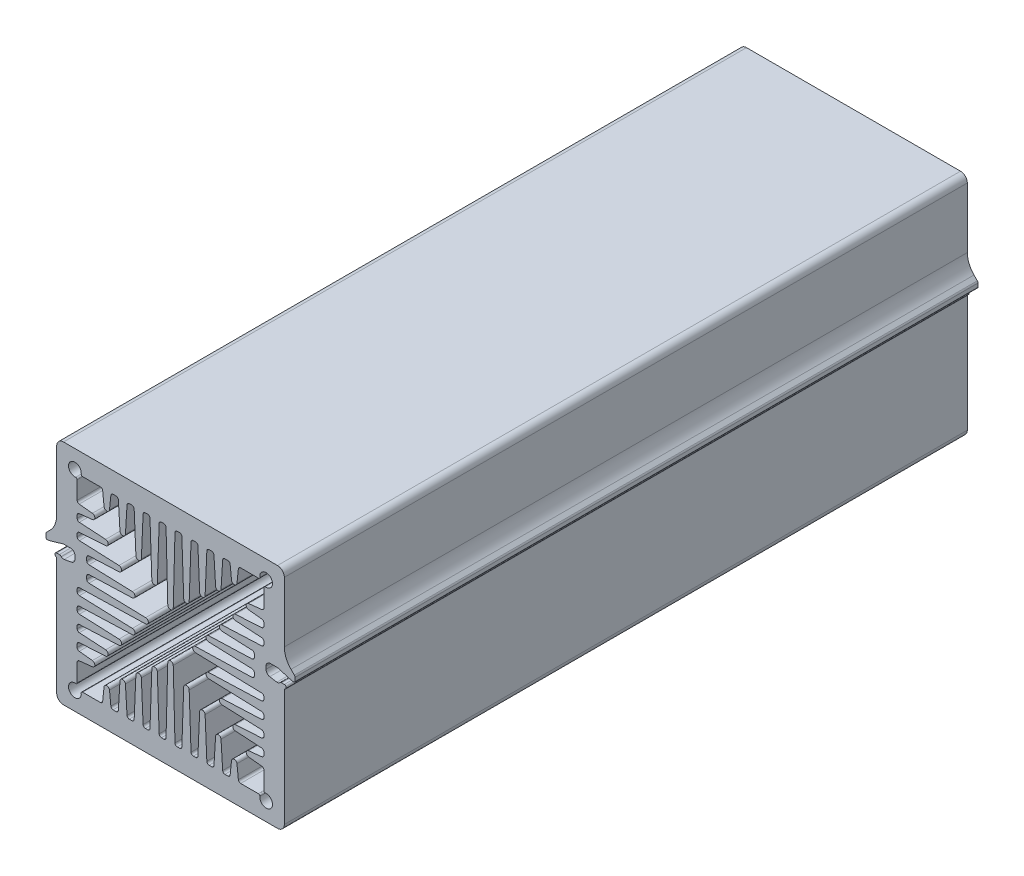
from build123d import *

# Parameters (mm, degrees)
BOSS_EXTRUDE1_DEPTH = 150


with BuildPart() as part:
    # Sketch1 → Boss-Extrude1 (new body)
    with BuildSketch(Plane(origin=(0, 0, 0), x_dir=(-1, 0, 0), z_dir=(0, 0, -1))):
        with BuildLine():
            Line((3e-09, 35.269754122), (3e-09, 48.499999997))
            ThreePointArc((3e-09, 48.499999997), (-0.439339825, 49.560660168), (-1.499999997, 49.999999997))
            Line((-1.499999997, 49.999999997), (-48.499999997, 49.999999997))
            ThreePointArc((-48.499999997, 49.999999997), (-49.560660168, 49.560660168), (-49.999999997, 48.499999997))
            Line((-49.999999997, 48.499999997), (-49.999999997, 35.269754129))
            ThreePointArc((-49.999999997, 35.269754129), (-50.380602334, 33.356336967), (-51.464466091, 31.734220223))
            Line((-51.464466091, 31.734220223), (-52.198025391, 31.000660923))
            ThreePointArc((-52.198025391, 31.000660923), (-52.306411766, 30.838449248), (-52.344472, 30.647107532))
            Line((-52.344472, 30.647107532), (-52.344472, 29.847107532))
            ThreePointArc((-52.344472, 29.847107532), (-52.285893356, 29.705686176), (-52.144472, 29.647107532))
            Line((-52.144472, 29.647107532), (-51.857732, 29.647107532))
            ThreePointArc((-51.857732, 29.647107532), (-51.716083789, 29.657190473), (-51.577292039, 29.687235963))
            Line((-51.577292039, 29.687235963), (-48.641505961, 30.544967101))
            ThreePointArc((-48.641505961, 30.544967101), (-48.502714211, 30.575012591), (-48.361066, 30.585095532))
            Line((-48.361066, 30.585095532), (-46.969175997, 30.585095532))
            ThreePointArc((-46.969175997, 30.585095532), (-46.262069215, 30.292202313), (-45.969175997, 29.585095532))
            Line((-45.969175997, 29.585095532), (-45.969175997, 28.987326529))
            ThreePointArc((-45.969175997, 28.987326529), (-46.204101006, 28.343385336), (-46.798496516, 28.001999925))
            Line((-46.798496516, 28.001999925), (-48.35098536, 27.733075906))
            ThreePointArc((-48.35098536, 27.733075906), (-48.69363657, 27.759334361), (-48.982498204, 27.945501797))
            ThreePointArc((-48.982498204, 27.945501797), (-49.177977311, 28.083694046), (-49.412352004, 28.132455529))
            Line((-49.412352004, 28.132455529), (-49.999999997, 28.132455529))
            ThreePointArc((-49.999999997, 28.132455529), (-50.390231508, 27.820315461), (-50.171428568, 27.371052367))
            ThreePointArc((-50.171428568, 27.371052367), (-50.04645372, 27.260356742), (-49.999999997, 27.099999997))
            Line((-49.999999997, 27.099999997), (-49.999999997, 1.499999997))
            ThreePointArc((-49.999999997, 1.499999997), (-49.560660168, 0.439339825), (-48.499999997, -3e-09))
            Line((-48.499999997, -3e-09), (-1.499999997, -3e-09))
            ThreePointArc((-1.499999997, -3e-09), (-0.439339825, 0.439339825), (3e-09, 1.499999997))
            Line((3e-09, 1.499999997), (3e-09, 27.099999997))
            ThreePointArc((3e-09, 27.099999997), (0.046453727, 27.260356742), (0.171428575, 27.371052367))
            ThreePointArc((0.171428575, 27.371052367), (0.390231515, 27.820315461), (3e-09, 28.132455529))
            Line((3e-09, 28.132455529), (-0.587647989, 28.132455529))
            ThreePointArc((-0.587647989, 28.132455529), (-0.822022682, 28.083694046), (-1.017501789, 27.945501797))
            ThreePointArc((-1.017501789, 27.945501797), (-1.306363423, 27.759334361), (-1.649014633, 27.733075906))
            Line((-1.649014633, 27.733075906), (-3.201503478, 28.001999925))
            ThreePointArc((-3.201503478, 28.001999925), (-3.795898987, 28.343385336), (-4.030823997, 28.987326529))
            Line((-4.030823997, 28.987326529), (-4.030823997, 29.585095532))
            ThreePointArc((-4.030823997, 29.585095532), (-3.737930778, 30.292202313), (-3.030823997, 30.585095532))
            Line((-3.030823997, 30.585095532), (-1.638934, 30.585095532))
            ThreePointArc((-1.638934, 30.585095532), (-1.497285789, 30.575012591), (-1.358494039, 30.544967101))
            Line((-1.358494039, 30.544967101), (1.577292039, 29.687235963))
            ThreePointArc((1.577292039, 29.687235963), (1.716083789, 29.657190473), (1.857732, 29.647107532))
            Line((1.857732, 29.647107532), (2.144472, 29.647107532))
            ThreePointArc((2.144472, 29.647107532), (2.285893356, 29.705686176), (2.344472, 29.847107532))
            Line((2.344472, 29.847107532), (2.344472, 30.647107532))
            ThreePointArc((2.344472, 30.647107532), (2.306411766, 30.838449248), (2.198025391, 31.000660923))
            Line((2.198025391, 31.000660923), (1.464466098, 31.734220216))
            ThreePointArc((1.464466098, 31.734220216), (0.380602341, 33.35633696), (3e-09, 35.269754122))
        make_face()
        with BuildLine():
            Line((-44.311805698, 45.5), (-40.399299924, 45.5))
            ThreePointArc((-40.399299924, 45.5), (-40.064734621, 45.371572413), (-39.902038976, 45.052264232))
            Line((-39.902038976, 45.052264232), (-39.596713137, 42.147282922))
            ThreePointArc((-39.596713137, 42.147282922), (-39, 41.61), (-38.403286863, 42.147282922))
            Line((-38.403286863, 42.147282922), (-38.097961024, 45.052264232))
            ThreePointArc((-38.097961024, 45.052264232), (-37.935265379, 45.371572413), (-37.600700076, 45.5))
            Line((-37.600700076, 45.5), (-36.951905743, 45.5))
            ThreePointArc((-36.951905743, 45.5), (-36.609314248, 45.364185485), (-36.452838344, 45.03052427))
            Line((-36.452838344, 45.03052427), (-36.098880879, 39.243370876))
            ThreePointArc((-36.098880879, 39.243370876), (-35.5, 38.68), (-34.901119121, 39.243370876))
            Line((-34.901119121, 39.243370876), (-34.547161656, 45.03052427))
            ThreePointArc((-34.547161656, 45.03052427), (-34.390685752, 45.364185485), (-34.048094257, 45.5))
            Line((-34.048094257, 45.5), (-33.479151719, 45.5))
            ThreePointArc((-33.479151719, 45.5), (-33.133395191, 45.361181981), (-32.979627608, 45.021809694))
            Line((-32.979627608, 45.021809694), (-32.599428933, 36.313828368))
            ThreePointArc((-32.599428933, 36.313828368), (-32, 35.74), (-31.400571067, 36.313828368))
            Line((-31.400571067, 36.313828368), (-31.020372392, 45.021809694))
            ThreePointArc((-31.020372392, 45.021809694), (-30.866604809, 45.361181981), (-30.520848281, 45.5))
            Line((-30.520848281, 45.5), (-30.005751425, 45.5))
            ThreePointArc((-30.005751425, 45.5), (-29.65842224, 45.3596699), (-29.506056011, 45.017449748))
            Line((-29.506056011, 45.017449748), (-29.099634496, 33.379060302))
            ThreePointArc((-29.099634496, 33.379060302), (-28.5, 32.8), (-27.900365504, 33.379060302))
            Line((-27.900365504, 33.379060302), (-27.493943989, 45.017449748))
            ThreePointArc((-27.493943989, 45.017449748), (-27.34157776, 45.3596699), (-26.994248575, 45.5))
            Line((-26.994248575, 45.5), (-26.480727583, 45.5))
            ThreePointArc((-26.480727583, 45.5), (-26.131832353, 45.358150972), (-25.98089892, 45.013088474))
            Line((-25.98089892, 45.013088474), (-25.599794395, 30.459293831))
            ThreePointArc((-25.599794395, 30.459293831), (-25, 29.875), (-24.400205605, 30.459293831))
            Line((-24.400205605, 30.459293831), (-24.01910108, 45.013088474))
            ThreePointArc((-24.01910108, 45.013088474), (-23.868167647, 45.358150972), (-23.519272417, 45.5))
            Line((-23.519272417, 45.5), (-23.005751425, 45.5))
            ThreePointArc((-23.005751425, 45.5), (-22.65842224, 45.3596699), (-22.506056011, 45.017449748))
            Line((-22.506056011, 45.017449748), (-22.099634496, 33.379060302))
            ThreePointArc((-22.099634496, 33.379060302), (-21.5, 32.8), (-20.900365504, 33.379060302))
            Line((-20.900365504, 33.379060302), (-20.493943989, 45.017449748))
            ThreePointArc((-20.493943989, 45.017449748), (-20.34157776, 45.3596699), (-19.994248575, 45.5))
            Line((-19.994248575, 45.5), (-19.479151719, 45.5))
            ThreePointArc((-19.479151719, 45.5), (-19.133395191, 45.361181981), (-18.979627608, 45.021809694))
            Line((-18.979627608, 45.021809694), (-18.599428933, 36.313828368))
            ThreePointArc((-18.599428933, 36.313828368), (-18, 35.74), (-17.400571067, 36.313828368))
            Line((-17.400571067, 36.313828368), (-17.020372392, 45.021809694))
            ThreePointArc((-17.020372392, 45.021809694), (-16.866604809, 45.361181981), (-16.520848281, 45.5))
            Line((-16.520848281, 45.5), (-15.951905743, 45.5))
            ThreePointArc((-15.951905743, 45.5), (-15.609314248, 45.364185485), (-15.452838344, 45.03052427))
            Line((-15.452838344, 45.03052427), (-15.098880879, 39.243370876))
            ThreePointArc((-15.098880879, 39.243370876), (-14.5, 38.68), (-13.901119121, 39.243370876))
            Line((-13.901119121, 39.243370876), (-13.547161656, 45.03052427))
            ThreePointArc((-13.547161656, 45.03052427), (-13.390685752, 45.364185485), (-13.048094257, 45.5))
            Line((-13.048094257, 45.5), (-12.399299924, 45.5))
            ThreePointArc((-12.399299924, 45.5), (-12.064734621, 45.371572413), (-11.902038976, 45.052264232))
            Line((-11.902038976, 45.052264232), (-11.596713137, 42.147282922))
            ThreePointArc((-11.596713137, 42.147282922), (-11, 41.61), (-10.403286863, 42.147282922))
            Line((-10.403286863, 42.147282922), (-10.097961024, 45.052264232))
            ThreePointArc((-10.097961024, 45.052264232), (-9.935265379, 45.371572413), (-9.600700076, 45.5))
            Line((-9.600700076, 45.5), (-5.688194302, 45.5))
            ThreePointArc((-5.688194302, 45.5), (-5.463930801, 45.600736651), (-5.39027766, 45.835294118))
            ThreePointArc((-5.39027766, 45.835294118), (-3.010050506, 46.989949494), (-4.164705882, 44.60972234))
            ThreePointArc((-4.164705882, 44.60972234), (-4.399263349, 44.536069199), (-4.5, 44.311805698))
            Line((-4.5, 44.311805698), (-4.5, 40.398248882))
            ThreePointArc((-4.5, 40.398248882), (-4.628427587, 40.063683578), (-4.947735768, 39.900987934))
            Line((-4.947735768, 39.900987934), (-7.842717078, 39.596713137))
            ThreePointArc((-7.842717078, 39.596713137), (-8.38, 39), (-7.842717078, 38.403286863))
            Line((-7.842717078, 38.403286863), (-4.947735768, 38.099012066))
            ThreePointArc((-4.947735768, 38.099012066), (-4.628427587, 37.936316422), (-4.5, 37.601751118))
            Line((-4.5, 37.601751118), (-4.5, 36.951905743))
            ThreePointArc((-4.5, 36.951905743), (-4.635814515, 36.609314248), (-4.96947573, 36.452838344))
            Line((-4.96947573, 36.452838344), (-10.756629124, 36.098880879))
            ThreePointArc((-10.756629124, 36.098880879), (-11.32, 35.5), (-10.756629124, 34.901119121))
            Line((-10.756629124, 34.901119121), (-4.96947573, 34.547161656))
            ThreePointArc((-4.96947573, 34.547161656), (-4.635814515, 34.390685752), (-4.5, 34.048094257))
            Line((-4.5, 34.048094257), (-4.5, 33.479151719))
            ThreePointArc((-4.5, 33.479151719), (-4.638818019, 33.133395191), (-4.978190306, 32.979627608))
            Line((-4.978190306, 32.979627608), (-13.686171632, 32.599428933))
            ThreePointArc((-13.686171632, 32.599428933), (-14.26, 32), (-13.686171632, 31.400571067))
            Line((-13.686171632, 31.400571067), (-7.078190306, 31.112060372))
            ThreePointArc((-7.078190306, 31.112060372), (-6.738818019, 30.958292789), (-6.6, 30.612536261))
            Line((-6.6, 30.612536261), (-6.6, 29.932417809))
            ThreePointArc((-6.6, 29.932417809), (-6.7403301, 29.585088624), (-7.082550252, 29.432722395))
            Line((-7.082550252, 29.432722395), (-16.620939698, 29.099634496))
            ThreePointArc((-16.620939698, 29.099634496), (-17.2, 28.5), (-16.620939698, 27.900365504))
            Line((-16.620939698, 27.900365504), (-7.082550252, 27.567277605))
            ThreePointArc((-7.082550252, 27.567277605), (-6.7403301, 27.414911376), (-6.6, 27.067582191))
            Line((-6.6, 27.067582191), (-6.6, 26.425737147))
            ThreePointArc((-6.6, 26.425737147), (-6.741849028, 26.076841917), (-7.086911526, 25.925908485))
            Line((-7.086911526, 25.925908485), (-19.540706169, 25.599794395))
            ThreePointArc((-19.540706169, 25.599794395), (-20.125, 25), (-19.540706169, 24.400205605))
            Line((-19.540706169, 24.400205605), (-4.986911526, 24.01910108))
            ThreePointArc((-4.986911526, 24.01910108), (-4.641849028, 23.868167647), (-4.5, 23.519272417))
            Line((-4.5, 23.519272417), (-4.5, 23.005751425))
            ThreePointArc((-4.5, 23.005751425), (-4.6403301, 22.65842224), (-4.982550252, 22.506056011))
            Line((-4.982550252, 22.506056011), (-16.620939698, 22.099634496))
            ThreePointArc((-16.620939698, 22.099634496), (-17.2, 21.5), (-16.620939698, 20.900365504))
            Line((-16.620939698, 20.900365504), (-4.982550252, 20.493943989))
            ThreePointArc((-4.982550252, 20.493943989), (-4.6403301, 20.34157776), (-4.5, 19.994248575))
            Line((-4.5, 19.994248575), (-4.5, 19.479151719))
            ThreePointArc((-4.5, 19.479151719), (-4.638818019, 19.133395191), (-4.978190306, 18.979627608))
            Line((-4.978190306, 18.979627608), (-13.686171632, 18.599428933))
            ThreePointArc((-13.686171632, 18.599428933), (-14.26, 18), (-13.686171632, 17.400571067))
            Line((-13.686171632, 17.400571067), (-4.978190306, 17.020372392))
            ThreePointArc((-4.978190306, 17.020372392), (-4.638818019, 16.866604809), (-4.5, 16.520848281))
            Line((-4.5, 16.520848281), (-4.5, 15.951905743))
            ThreePointArc((-4.5, 15.951905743), (-4.635814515, 15.609314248), (-4.96947573, 15.452838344))
            Line((-4.96947573, 15.452838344), (-10.756629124, 15.098880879))
            ThreePointArc((-10.756629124, 15.098880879), (-11.32, 14.5), (-10.756629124, 13.901119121))
            Line((-10.756629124, 13.901119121), (-4.96947573, 13.547161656))
            ThreePointArc((-4.96947573, 13.547161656), (-4.635814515, 13.390685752), (-4.5, 13.048094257))
            Line((-4.5, 13.048094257), (-4.5, 12.398248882))
            ThreePointArc((-4.5, 12.398248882), (-4.628427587, 12.063683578), (-4.947735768, 11.900987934))
            Line((-4.947735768, 11.900987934), (-7.842717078, 11.596713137))
            ThreePointArc((-7.842717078, 11.596713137), (-8.38, 11), (-7.842717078, 10.403286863))
            Line((-7.842717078, 10.403286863), (-4.947735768, 10.099012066))
            ThreePointArc((-4.947735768, 10.099012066), (-4.628427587, 9.936316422), (-4.5, 9.601751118))
            Line((-4.5, 9.601751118), (-4.5, 5.688194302))
            ThreePointArc((-4.5, 5.688194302), (-4.399263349, 5.463930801), (-4.164705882, 5.39027766))
            ThreePointArc((-4.164705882, 5.39027766), (-3.010050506, 3.010050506), (-5.39027766, 4.164705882))
            ThreePointArc((-5.39027766, 4.164705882), (-5.463930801, 4.399263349), (-5.688194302, 4.5))
            Line((-5.688194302, 4.5), (-9.600700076, 4.5))
            ThreePointArc((-9.600700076, 4.5), (-9.935265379, 4.628427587), (-10.097961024, 4.947735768))
            Line((-10.097961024, 4.947735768), (-10.403286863, 7.852717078))
            ThreePointArc((-10.403286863, 7.852717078), (-11, 8.39), (-11.596713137, 7.852717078))
            Line((-11.596713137, 7.852717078), (-11.902038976, 4.947735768))
            ThreePointArc((-11.902038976, 4.947735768), (-12.064734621, 4.628427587), (-12.399299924, 4.5))
            Line((-12.399299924, 4.5), (-13.048094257, 4.5))
            ThreePointArc((-13.048094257, 4.5), (-13.390685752, 4.635814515), (-13.547161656, 4.96947573))
            Line((-13.547161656, 4.96947573), (-13.901119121, 10.756629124))
            ThreePointArc((-13.901119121, 10.756629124), (-14.5, 11.32), (-15.098880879, 10.756629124))
            Line((-15.098880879, 10.756629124), (-15.452838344, 4.96947573))
            ThreePointArc((-15.452838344, 4.96947573), (-15.609314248, 4.635814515), (-15.951905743, 4.5))
            Line((-15.951905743, 4.5), (-16.520848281, 4.5))
            ThreePointArc((-16.520848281, 4.5), (-16.866604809, 4.638818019), (-17.020372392, 4.978190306))
            Line((-17.020372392, 4.978190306), (-17.400571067, 13.686171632))
            ThreePointArc((-17.400571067, 13.686171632), (-18, 14.26), (-18.599428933, 13.686171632))
            Line((-18.599428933, 13.686171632), (-18.979627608, 4.978190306))
            ThreePointArc((-18.979627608, 4.978190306), (-19.133395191, 4.638818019), (-19.479151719, 4.5))
            Line((-19.479151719, 4.5), (-19.994248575, 4.5))
            ThreePointArc((-19.994248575, 4.5), (-20.34157776, 4.6403301), (-20.493943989, 4.982550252))
            Line((-20.493943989, 4.982550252), (-20.900365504, 16.620939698))
            ThreePointArc((-20.900365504, 16.620939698), (-21.5, 17.2), (-22.099634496, 16.620939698))
            Line((-22.099634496, 16.620939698), (-22.506056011, 4.982550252))
            ThreePointArc((-22.506056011, 4.982550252), (-22.65842224, 4.6403301), (-23.005751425, 4.5))
            Line((-23.005751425, 4.5), (-23.519272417, 4.5))
            ThreePointArc((-23.519272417, 4.5), (-23.868167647, 4.641849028), (-24.01910108, 4.986911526))
            Line((-24.01910108, 4.986911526), (-24.400205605, 19.540706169))
            ThreePointArc((-24.400205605, 19.540706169), (-25, 20.125), (-25.599794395, 19.540706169))
            Line((-25.599794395, 19.540706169), (-25.98089892, 4.986911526))
            ThreePointArc((-25.98089892, 4.986911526), (-26.131832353, 4.641849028), (-26.480727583, 4.5))
            Line((-26.480727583, 4.5), (-26.994248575, 4.5))
            ThreePointArc((-26.994248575, 4.5), (-27.34157776, 4.6403301), (-27.493943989, 4.982550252))
            Line((-27.493943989, 4.982550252), (-27.900365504, 16.620939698))
            ThreePointArc((-27.900365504, 16.620939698), (-28.5, 17.2), (-29.099634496, 16.620939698))
            Line((-29.099634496, 16.620939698), (-29.506056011, 4.982550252))
            ThreePointArc((-29.506056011, 4.982550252), (-29.65842224, 4.6403301), (-30.005751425, 4.5))
            Line((-30.005751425, 4.5), (-30.520848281, 4.5))
            ThreePointArc((-30.520848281, 4.5), (-30.866604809, 4.638818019), (-31.020372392, 4.978190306))
            Line((-31.020372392, 4.978190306), (-31.400571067, 13.686171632))
            ThreePointArc((-31.400571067, 13.686171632), (-32, 14.26), (-32.599428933, 13.686171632))
            Line((-32.599428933, 13.686171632), (-32.979627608, 4.978190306))
            ThreePointArc((-32.979627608, 4.978190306), (-33.133395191, 4.638818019), (-33.479151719, 4.5))
            Line((-33.479151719, 4.5), (-34.048094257, 4.5))
            ThreePointArc((-34.048094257, 4.5), (-34.390685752, 4.635814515), (-34.547161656, 4.96947573))
            Line((-34.547161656, 4.96947573), (-34.901119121, 10.756629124))
            ThreePointArc((-34.901119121, 10.756629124), (-35.5, 11.32), (-36.098880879, 10.756629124))
            Line((-36.098880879, 10.756629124), (-36.452838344, 4.96947573))
            ThreePointArc((-36.452838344, 4.96947573), (-36.609314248, 4.635814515), (-36.951905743, 4.5))
            Line((-36.951905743, 4.5), (-37.600700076, 4.5))
            ThreePointArc((-37.600700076, 4.5), (-37.935265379, 4.628427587), (-38.097961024, 4.947735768))
            Line((-38.097961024, 4.947735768), (-38.403286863, 7.852717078))
            ThreePointArc((-38.403286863, 7.852717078), (-39, 8.39), (-39.596713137, 7.852717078))
            Line((-39.596713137, 7.852717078), (-39.902038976, 4.947735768))
            ThreePointArc((-39.902038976, 4.947735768), (-40.064734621, 4.628427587), (-40.399299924, 4.5))
            Line((-40.399299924, 4.5), (-44.311805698, 4.5))
            ThreePointArc((-44.311805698, 4.5), (-44.536069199, 4.399263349), (-44.60972234, 4.164705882))
            ThreePointArc((-44.60972234, 4.164705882), (-46.989949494, 3.010050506), (-45.835294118, 5.39027766))
            ThreePointArc((-45.835294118, 5.39027766), (-45.600736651, 5.463930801), (-45.5, 5.688194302))
            Line((-45.5, 5.688194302), (-45.5, 9.601751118))
            ThreePointArc((-45.5, 9.601751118), (-45.371572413, 9.936316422), (-45.052264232, 10.099012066))
            Line((-45.052264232, 10.099012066), (-42.157282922, 10.403286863))
            ThreePointArc((-42.157282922, 10.403286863), (-41.62, 11), (-42.157282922, 11.596713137))
            Line((-42.157282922, 11.596713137), (-45.052264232, 11.900987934))
            ThreePointArc((-45.052264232, 11.900987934), (-45.371572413, 12.063683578), (-45.5, 12.398248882))
            Line((-45.5, 12.398248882), (-45.5, 13.048094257))
            ThreePointArc((-45.5, 13.048094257), (-45.364185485, 13.390685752), (-45.03052427, 13.547161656))
            Line((-45.03052427, 13.547161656), (-39.243370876, 13.901119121))
            ThreePointArc((-39.243370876, 13.901119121), (-38.68, 14.5), (-39.243370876, 15.098880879))
            Line((-39.243370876, 15.098880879), (-45.03052427, 15.452838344))
            ThreePointArc((-45.03052427, 15.452838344), (-45.364185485, 15.609314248), (-45.5, 15.951905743))
            Line((-45.5, 15.951905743), (-45.5, 16.520848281))
            ThreePointArc((-45.5, 16.520848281), (-45.361181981, 16.866604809), (-45.021809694, 17.020372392))
            Line((-45.021809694, 17.020372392), (-36.313828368, 17.400571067))
            ThreePointArc((-36.313828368, 17.400571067), (-35.74, 18), (-36.313828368, 18.599428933))
            Line((-36.313828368, 18.599428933), (-45.021809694, 18.979627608))
            ThreePointArc((-45.021809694, 18.979627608), (-45.361181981, 19.133395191), (-45.5, 19.479151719))
            Line((-45.5, 19.479151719), (-45.5, 19.994248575))
            ThreePointArc((-45.5, 19.994248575), (-45.3596699, 20.34157776), (-45.017449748, 20.493943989))
            Line((-45.017449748, 20.493943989), (-33.379060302, 20.900365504))
            ThreePointArc((-33.379060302, 20.900365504), (-32.8, 21.5), (-33.379060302, 22.099634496))
            Line((-33.379060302, 22.099634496), (-45.017449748, 22.506056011))
            ThreePointArc((-45.017449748, 22.506056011), (-45.3596699, 22.65842224), (-45.5, 23.005751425))
            Line((-45.5, 23.005751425), (-45.5, 23.519272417))
            ThreePointArc((-45.5, 23.519272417), (-45.358150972, 23.868167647), (-45.013088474, 24.01910108))
            Line((-45.013088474, 24.01910108), (-30.459293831, 24.400205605))
            ThreePointArc((-30.459293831, 24.400205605), (-29.875, 25), (-30.459293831, 25.599794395))
            Line((-30.459293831, 25.599794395), (-42.913088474, 25.925908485))
            ThreePointArc((-42.913088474, 25.925908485), (-43.258150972, 26.076841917), (-43.4, 26.425737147))
            Line((-43.4, 26.425737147), (-43.4, 27.067582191))
            ThreePointArc((-43.4, 27.067582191), (-43.2596699, 27.414911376), (-42.917449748, 27.567277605))
            Line((-42.917449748, 27.567277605), (-33.379060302, 27.900365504))
            ThreePointArc((-33.379060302, 27.900365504), (-32.8, 28.5), (-33.379060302, 29.099634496))
            Line((-33.379060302, 29.099634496), (-42.917449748, 29.432722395))
            ThreePointArc((-42.917449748, 29.432722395), (-43.2596699, 29.585088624), (-43.4, 29.932417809))
            Line((-43.4, 29.932417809), (-43.4, 30.612536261))
            ThreePointArc((-43.4, 30.612536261), (-43.261181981, 30.958292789), (-42.921809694, 31.112060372))
            Line((-42.921809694, 31.112060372), (-36.313828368, 31.400571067))
            ThreePointArc((-36.313828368, 31.400571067), (-35.74, 32), (-36.313828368, 32.599428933))
            Line((-36.313828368, 32.599428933), (-45.021809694, 32.979627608))
            ThreePointArc((-45.021809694, 32.979627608), (-45.361181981, 33.133395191), (-45.5, 33.479151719))
            Line((-45.5, 33.479151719), (-45.5, 34.048094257))
            ThreePointArc((-45.5, 34.048094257), (-45.364185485, 34.390685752), (-45.03052427, 34.547161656))
            Line((-45.03052427, 34.547161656), (-39.243370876, 34.901119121))
            ThreePointArc((-39.243370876, 34.901119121), (-38.68, 35.5), (-39.243370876, 36.098880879))
            Line((-39.243370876, 36.098880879), (-45.03052427, 36.452838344))
            ThreePointArc((-45.03052427, 36.452838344), (-45.364185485, 36.609314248), (-45.5, 36.951905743))
            Line((-45.5, 36.951905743), (-45.5, 37.601751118))
            ThreePointArc((-45.5, 37.601751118), (-45.371572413, 37.936316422), (-45.052264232, 38.099012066))
            Line((-45.052264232, 38.099012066), (-42.157282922, 38.403286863))
            ThreePointArc((-42.157282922, 38.403286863), (-41.62, 39), (-42.157282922, 39.596713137))
            Line((-42.157282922, 39.596713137), (-45.052264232, 39.900987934))
            ThreePointArc((-45.052264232, 39.900987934), (-45.371572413, 40.063683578), (-45.5, 40.398248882))
            Line((-45.5, 40.398248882), (-45.5, 44.311805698))
            ThreePointArc((-45.5, 44.311805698), (-45.600736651, 44.536069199), (-45.835294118, 44.60972234))
            ThreePointArc((-45.835294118, 44.60972234), (-46.989949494, 46.989949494), (-44.60972234, 45.835294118))
            ThreePointArc((-44.60972234, 45.835294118), (-44.536069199, 45.600736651), (-44.311805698, 45.5))
        make_face(mode=Mode.SUBTRACT)
    extrude(amount=-BOSS_EXTRUDE1_DEPTH)


solid = part.part
